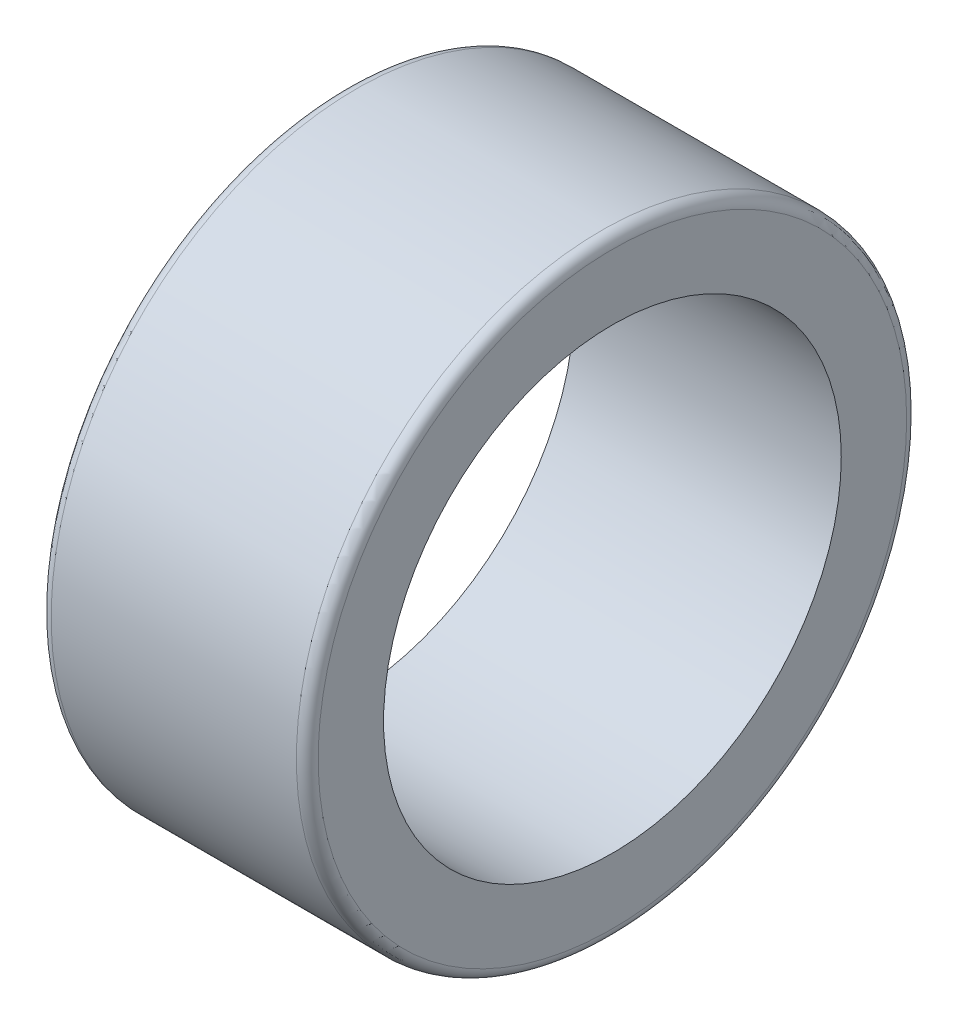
from build123d import *


with BuildPart() as part:
    # Esquisse1 → R_volution1 (revolve)
    with BuildSketch(Plane.XY, mode=Mode.PRIVATE) as r_volution1_sk:
        with BuildLine():
            Line((1, 28), (23.5, 28))
            ThreePointArc((23.5, 28), (24.207106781, 27.707106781), (24.5, 27))
            Line((24.5, 27), (24.5, 21))
            Line((24.5, 21), (0, 21))
            Line((0, 21), (0, 27))
            ThreePointArc((0, 27), (0.292893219, 27.707106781), (1, 28))
        make_face()
    revolve(r_volution1_sk.sketch.rotate(Axis((39.288346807, 0, 0), (-1, 0, 0)), 90), axis=Axis((39.288346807, 0, 0), (-1, 0, 0)))


solid = part.part
